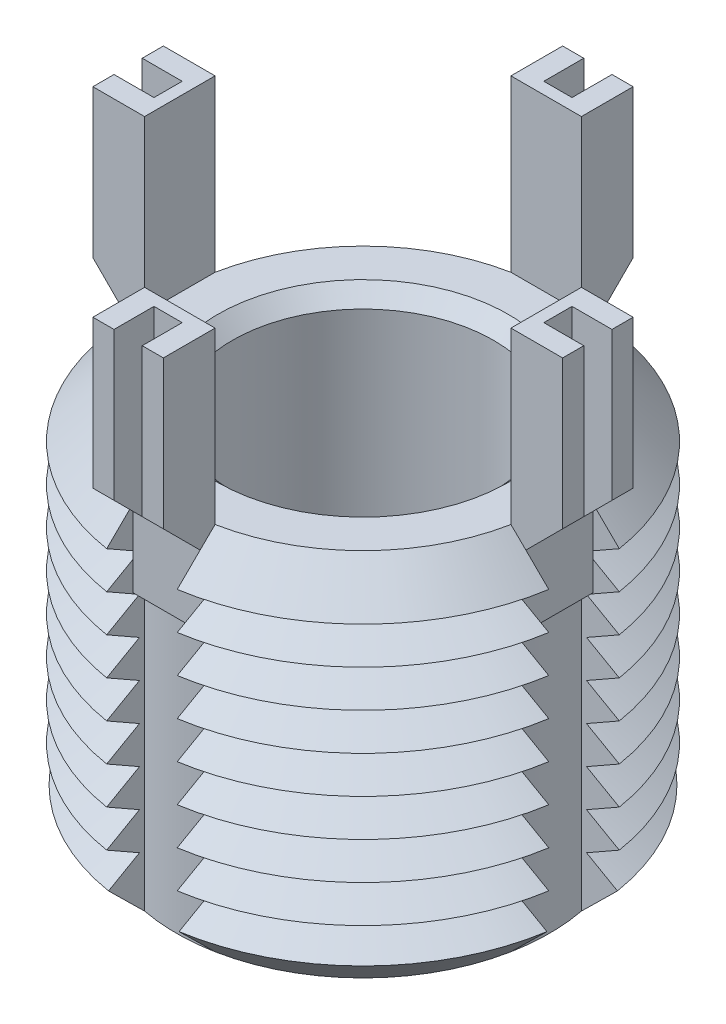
from build123d import *

# Parameters (mm, degrees)
SKETCH1_R               = 9.525
BOSS_EXTRUDE1_DEPTH     = 15.748
CHAMFER1_SIZE           = 1.587
LPATTERN1_COUNT         = 8
LPATTERN1_PITCH         = 1.587
CUT_EXTRUDE1_REACH      = 22.723
CIRPATTERN1_COUNT       = 4
BOSS_EXTRUDE3_DEPTH     = 1.5
CIRPATTERN2_COUNT       = 4
CUT_EXTRUDE3_DEPTH      = 27.985213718
CUT_EXTRUDE3_DEPTH_BACK = 27.985213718
SKETCH6_W               = 1.7
SKETCH6_H               = 1.2
SKETCH6_W_2             = 1.2
SKETCH6_H_2             = 1.7
SKETCH7_R               = 5.556
CUT_EXTRUDE4_DEPTH      = 15.748
CHAMFER2_SIZE           = 0.635


with BuildPart() as part:
    # Sketch1 → Boss-Extrude1 (new body)
    with BuildSketch(Plane(origin=(0, 0, 0), x_dir=(1, 0, 0), z_dir=(0, 1, 0))):
        with Locations(Location((0, 0, 0), (0, 0, 270))):
            Circle(SKETCH1_R)
    extrude(amount=-BOSS_EXTRUDE1_DEPTH)

    # Chamfer1
    chamfer1_edges = [part.edges().sort_by_distance(p)[0] for p in [
        (0, 0, -9.525),
        (0, -15.748, -9.525),
    ]]
    chamfer(chamfer1_edges, length=CHAMFER1_SIZE)

    # Sketch3 → Cut-Revolve1 (revolve, cut)
    with BuildSketch(Plane(origin=(0, 0, 0), x_dir=(0, 0, -1), z_dir=(1, 0, 0))):
        Polygon((-9.525, -1.587), (-8.150617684, -2.3805), (-9.525, -3.174), align=None)
    cut_revolve1 = revolve(axis=Axis((0, 0.885892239, 0), (0, -1, 0)), mode=Mode.SUBTRACT)

    # LPattern1: Cut-Revolve1 ×8
    with Locations(*[(0, -i * LPATTERN1_PITCH, 0) for i in range(1, LPATTERN1_COUNT)]):
        add(cut_revolve1, mode=Mode.SUBTRACT)

    # Cut-Extrude1: up to this cone (the profile starts inside it)
    cut_extrude1_end = Plane(origin=(0, 0, 0), z_dir=(0, 1, 0)).offset(-23.685999) * Cone(1e-06, 70.595, 70.594999, align=(Align.CENTER, Align.CENTER, Align.MIN), mode=Mode.PRIVATE)
    # Sketch4 → Cut-Extrude1 (cut, up to the surface)
    with BuildSketch(Plane(origin=(0, 0, 0), x_dir=(1, 0, 0), z_dir=(0, 1, 0)), mode=Mode.PRIVATE) as cut_extrude1_sk1:
        with BuildLine():
            Line((-7.79498839, 1.5), (-9.406148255, 1.5))
            ThreePointArc((-9.406148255, 1.5), (-9.525, 0), (-9.406148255, -1.5))
            Line((-9.406148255, -1.5), (-7.79498839, -1.5))
            ThreePointArc((-7.79498839, -1.5), (-7.938, 0), (-7.79498839, 1.5))
        make_face()
    cut_extrude1_tool1 = extrude(cut_extrude1_sk1.sketch, amount=-CUT_EXTRUDE1_REACH, mode=Mode.PRIVATE) & cut_extrude1_end
    cut_extrude1 = cut_extrude1_tool1.solids().sort_by_distance((-8.687817, 0, 0))[0]
    add(cut_extrude1, mode=Mode.SUBTRACT)

    # CirPattern1: Cut-Extrude1 ×4 about axis
    cirpattern1_axis = Axis((0, 0, 0), (0, 1, 0))
    for i in range(1, CIRPATTERN1_COUNT):
        add(cut_extrude1.rotate(cirpattern1_axis, i * 360 / CIRPATTERN1_COUNT), mode=Mode.SUBTRACT)

    # Sketch5 → Boss-Extrude3 (add, symmetric)
    with BuildSketch(Plane(origin=(0, 0, 0), x_dir=(0, 0, -1), z_dir=(1, 0, 0))):
        Polygon((-7.79498839, 7.239), (-7.79498839, -3.761), (-8.29498839, -3.761), (-8.29498839, -0.761), (-9.99498839, 0.939), (-9.99498839, 7.239), align=None)
    boss_extrude3 = extrude(amount=BOSS_EXTRUDE3_DEPTH, both=True)

    # CirPattern2: Boss-Extrude3 ×4 about axis
    cirpattern2_axis = Axis((0, 0, 0), (0, 1, 0))
    for i in range(1, CIRPATTERN2_COUNT):
        add(boss_extrude3.rotate(cirpattern2_axis, i * 360 / CIRPATTERN2_COUNT))

    # Sketch6 → Cut-Extrude3 (cut, two sides: drawn at the far end of the back side and taken through both)
    with BuildSketch(Plane(origin=(0, 7.239, 0), x_dir=(1, 0, 0), z_dir=(0, 1, 0)).offset(-CUT_EXTRUDE3_DEPTH_BACK)):
        with Locations((-9.14498839, 0)):
            Rectangle(SKETCH6_W, SKETCH6_H)
        with Locations((0, 9.14498839)):
            Rectangle(SKETCH6_W_2, SKETCH6_H_2)
        with Locations((9.14498839, 0)):
            Rectangle(SKETCH6_W, SKETCH6_H)
        with Locations((0, -9.14498839)):
            Rectangle(SKETCH6_W_2, SKETCH6_H_2)
    extrude(amount=CUT_EXTRUDE3_DEPTH + CUT_EXTRUDE3_DEPTH_BACK, mode=Mode.SUBTRACT)

    # Sketch7 → Cut-Extrude4 (cut)
    with BuildSketch(Plane(origin=(0, 0, 0), x_dir=(1, 0, 0), z_dir=(0, 1, 0))):
        with Locations(Location((0, 0, 0), (0, 0, 270))):
            Circle(SKETCH7_R)
    extrude(amount=-CUT_EXTRUDE4_DEPTH, mode=Mode.SUBTRACT)

    # Chamfer2
    chamfer2_edges = [part.edges().sort_by_distance(p)[0] for p in [
        (0, 0, -5.556),
        (0, -15.748, -5.556),
    ]]
    chamfer(chamfer2_edges, length=CHAMFER2_SIZE)


solid = part.part
